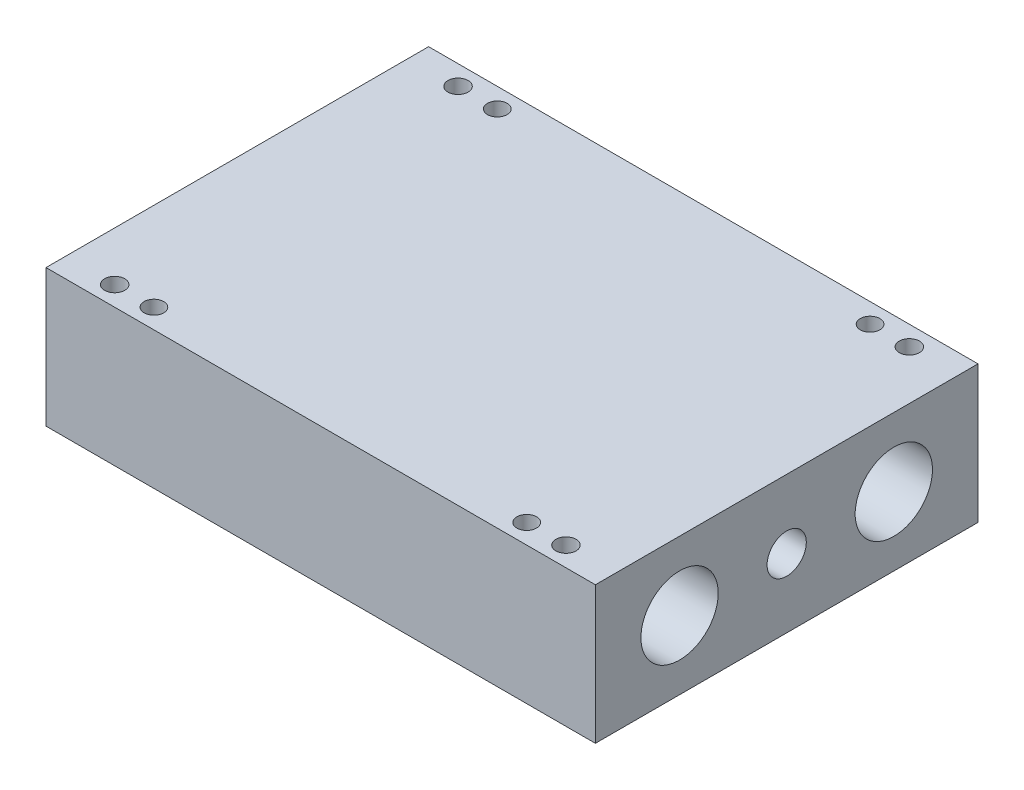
ISO-10303-21;
HEADER;
FILE_DESCRIPTION(('STEP AP214'),'2;1');
FILE_NAME('part.step','',(''),(''),'','','');
FILE_SCHEMA(('AUTOMOTIVE_DESIGN { 1 0 10303 214 1 1 1 1 }'));
ENDSEC;
DATA;
#1=APPLICATION_CONTEXT('core data for automotive mechanical design processes');
#2=APPLICATION_PROTOCOL_DEFINITION('international standard','automotive_design',2000,#1);
#3=PRODUCT_CONTEXT('',#1,'mechanical');
#4=PRODUCT('Part','Part','',(#3));
#5=PRODUCT_RELATED_PRODUCT_CATEGORY('part','',(#4));
#6=PRODUCT_DEFINITION_FORMATION('','',#4);
#7=PRODUCT_DEFINITION_CONTEXT('part definition',#1,'design');
#8=PRODUCT_DEFINITION('design','',#6,#7);
#9=PRODUCT_DEFINITION_SHAPE('','',#8);
#10=(LENGTH_UNIT() NAMED_UNIT(*) SI_UNIT(.MILLI.,.METRE.));
#11=(NAMED_UNIT(*) PLANE_ANGLE_UNIT() SI_UNIT($,.RADIAN.));
#12=(NAMED_UNIT(*) SI_UNIT($,.STERADIAN.) SOLID_ANGLE_UNIT());
#13=UNCERTAINTY_MEASURE_WITH_UNIT(LENGTH_MEASURE(1.E-05),#10,'distance_accuracy_value','');
#14=(GEOMETRIC_REPRESENTATION_CONTEXT(3) GLOBAL_UNCERTAINTY_ASSIGNED_CONTEXT((#13)) GLOBAL_UNIT_ASSIGNED_CONTEXT((#10,
#11,#12)) REPRESENTATION_CONTEXT('',''));
#15=CARTESIAN_POINT('',(0.,0.,0.));
#16=DIRECTION('',(0.,0.,1.));
#17=DIRECTION('',(1.,0.,0.));
#18=AXIS2_PLACEMENT_3D('',#15,#16,#17);
#19=CARTESIAN_POINT('',(88.9,22.225,-61.9125));
#20=DIRECTION('',(0.,-1.,0.));
#21=DIRECTION('',(0.,0.,-1.));
#22=AXIS2_PLACEMENT_3D('',#19,#20,#21);
#23=PLANE('',#22);
#24=CARTESIAN_POINT('',(-60.325,22.225,-55.5625));
#25=DIRECTION('',(0.,1.,0.));
#26=DIRECTION('',(0.,0.,1.));
#27=AXIS2_PLACEMENT_3D('',#24,#25,#26);
#28=CIRCLE('',#27,3.17500000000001);
#29=CARTESIAN_POINT('',(-60.325,22.225,-52.3875));
#30=VERTEX_POINT('',#29);
#31=EDGE_CURVE('E177',#30,#30,#28,.T.);
#32=ORIENTED_EDGE('',*,*,#31,.F.);
#33=EDGE_LOOP('',(#32));
#34=FACE_BOUND('',#33,.T.);
#35=CARTESIAN_POINT('',(60.325,22.225,-55.5625));
#36=DIRECTION('',(0.,1.,0.));
#37=DIRECTION('',(0.,0.,1.));
#38=AXIS2_PLACEMENT_3D('',#35,#36,#37);
#39=CIRCLE('',#38,3.17500000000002);
#40=CARTESIAN_POINT('',(60.325,22.225,-52.3875));
#41=VERTEX_POINT('',#40);
#42=EDGE_CURVE('E181',#41,#41,#39,.T.);
#43=ORIENTED_EDGE('',*,*,#42,.F.);
#44=EDGE_LOOP('',(#43));
#45=FACE_BOUND('',#44,.T.);
#46=CARTESIAN_POINT('',(60.325,22.225,55.5625));
#47=DIRECTION('',(0.,1.,0.));
#48=DIRECTION('',(0.,0.,1.));
#49=AXIS2_PLACEMENT_3D('',#46,#47,#48);
#50=CIRCLE('',#49,3.17500000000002);
#51=CARTESIAN_POINT('',(60.325,22.225,58.7375));
#52=VERTEX_POINT('',#51);
#53=EDGE_CURVE('E185',#52,#52,#50,.T.);
#54=ORIENTED_EDGE('',*,*,#53,.F.);
#55=EDGE_LOOP('',(#54));
#56=FACE_BOUND('',#55,.T.);
#57=CARTESIAN_POINT('',(-60.325,22.225,55.5625));
#58=DIRECTION('',(0.,1.,0.));
#59=DIRECTION('',(0.,0.,1.));
#60=AXIS2_PLACEMENT_3D('',#57,#58,#59);
#61=CIRCLE('',#60,3.17500000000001);
#62=CARTESIAN_POINT('',(-60.325,22.225,58.7375));
#63=VERTEX_POINT('',#62);
#64=EDGE_CURVE('E189',#63,#63,#61,.T.);
#65=ORIENTED_EDGE('',*,*,#64,.F.);
#66=EDGE_LOOP('',(#65));
#67=FACE_BOUND('',#66,.T.);
#68=CARTESIAN_POINT('',(-73.025,22.225,-55.5625));
#69=DIRECTION('',(0.,1.,0.));
#70=DIRECTION('',(0.,0.,1.));
#71=AXIS2_PLACEMENT_3D('',#68,#69,#70);
#72=CIRCLE('',#71,3.26389999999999);
#73=CARTESIAN_POINT('',(-73.025,22.225,-52.2986));
#74=VERTEX_POINT('',#73);
#75=EDGE_CURVE('E107',#74,#74,#72,.T.);
#76=ORIENTED_EDGE('',*,*,#75,.F.);
#77=EDGE_LOOP('',(#76));
#78=FACE_BOUND('',#77,.T.);
#79=CARTESIAN_POINT('',(73.025,22.225,-55.5625));
#80=DIRECTION('',(0.,1.,0.));
#81=DIRECTION('',(0.,0.,1.));
#82=AXIS2_PLACEMENT_3D('',#79,#80,#81);
#83=CIRCLE('',#82,3.26389999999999);
#84=CARTESIAN_POINT('',(73.025,22.225,-52.2986));
#85=VERTEX_POINT('',#84);
#86=EDGE_CURVE('E106',#85,#85,#83,.T.);
#87=ORIENTED_EDGE('',*,*,#86,.F.);
#88=EDGE_LOOP('',(#87));
#89=FACE_BOUND('',#88,.T.);
#90=CARTESIAN_POINT('',(73.025,22.225,55.5625));
#91=DIRECTION('',(0.,1.,0.));
#92=DIRECTION('',(0.,0.,1.));
#93=AXIS2_PLACEMENT_3D('',#90,#91,#92);
#94=CIRCLE('',#93,3.26389999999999);
#95=CARTESIAN_POINT('',(73.025,22.225,58.8264));
#96=VERTEX_POINT('',#95);
#97=EDGE_CURVE('E119',#96,#96,#94,.T.);
#98=ORIENTED_EDGE('',*,*,#97,.F.);
#99=EDGE_LOOP('',(#98));
#100=FACE_BOUND('',#99,.T.);
#101=CARTESIAN_POINT('',(-73.025,22.225,55.5625));
#102=DIRECTION('',(0.,1.,0.));
#103=DIRECTION('',(0.,0.,1.));
#104=AXIS2_PLACEMENT_3D('',#101,#102,#103);
#105=CIRCLE('',#104,3.26389999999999);
#106=CARTESIAN_POINT('',(-73.025,22.225,58.8264));
#107=VERTEX_POINT('',#106);
#108=EDGE_CURVE('E125',#107,#107,#105,.T.);
#109=ORIENTED_EDGE('',*,*,#108,.F.);
#110=EDGE_LOOP('',(#109));
#111=FACE_BOUND('',#110,.T.);
#112=DIRECTION('',(0.,0.,1.));
#113=VECTOR('',#112,1.);
#114=CARTESIAN_POINT('',(-88.9,22.225,-61.9125));
#115=LINE('',#114,#113);
#116=CARTESIAN_POINT('',(-88.9,22.225,-61.9125));
#117=VERTEX_POINT('',#116);
#118=CARTESIAN_POINT('',(-88.9,22.225,61.9125));
#119=VERTEX_POINT('',#118);
#120=EDGE_CURVE('E131',#117,#119,#115,.T.);
#121=ORIENTED_EDGE('',*,*,#120,.T.);
#122=DIRECTION('',(-1.,0.,0.));
#123=VECTOR('',#122,1.);
#124=CARTESIAN_POINT('',(88.9,22.225,61.9125));
#125=LINE('',#124,#123);
#126=CARTESIAN_POINT('',(88.9,22.225,61.9125));
#127=VERTEX_POINT('',#126);
#128=EDGE_CURVE('E11',#127,#119,#125,.T.);
#129=ORIENTED_EDGE('',*,*,#128,.F.);
#130=DIRECTION('',(0.,0.,1.));
#131=VECTOR('',#130,1.);
#132=CARTESIAN_POINT('',(88.9,22.225,-61.9125));
#133=LINE('',#132,#131);
#134=CARTESIAN_POINT('',(88.9,22.225,-61.9125));
#135=VERTEX_POINT('',#134);
#136=EDGE_CURVE('E132',#135,#127,#133,.T.);
#137=ORIENTED_EDGE('',*,*,#136,.F.);
#138=DIRECTION('',(-1.,0.,0.));
#139=VECTOR('',#138,1.);
#140=CARTESIAN_POINT('',(88.9,22.225,-61.9125));
#141=LINE('',#140,#139);
#142=EDGE_CURVE('E138',#135,#117,#141,.T.);
#143=ORIENTED_EDGE('',*,*,#142,.T.);
#144=EDGE_LOOP('',(#121,#129,#137,#143));
#145=FACE_BOUND('',#144,.T.);
#146=ADVANCED_FACE('F36',(#34,#45,#56,#67,#78,#89,#100,#111,#145),#23,.F.);
#147=CARTESIAN_POINT('',(88.9,22.225,61.9125));
#148=DIRECTION('',(0.,0.,-1.));
#149=DIRECTION('',(0.,1.,0.));
#150=AXIS2_PLACEMENT_3D('',#147,#148,#149);
#151=PLANE('',#150);
#152=DIRECTION('',(0.,-1.,0.));
#153=VECTOR('',#152,1.);
#154=CARTESIAN_POINT('',(-88.9,22.225,61.9125));
#155=LINE('',#154,#153);
#156=CARTESIAN_POINT('',(-88.9,-22.225,61.9125));
#157=VERTEX_POINT('',#156);
#158=EDGE_CURVE('E141',#119,#157,#155,.T.);
#159=ORIENTED_EDGE('',*,*,#158,.T.);
#160=DIRECTION('',(-1.,0.,0.));
#161=VECTOR('',#160,1.);
#162=CARTESIAN_POINT('',(88.9,-22.225,61.9125));
#163=LINE('',#162,#161);
#164=CARTESIAN_POINT('',(88.9,-22.225,61.9125));
#165=VERTEX_POINT('',#164);
#166=EDGE_CURVE('E44',#165,#157,#163,.T.);
#167=ORIENTED_EDGE('',*,*,#166,.F.);
#168=DIRECTION('',(0.,-1.,0.));
#169=VECTOR('',#168,1.);
#170=CARTESIAN_POINT('',(88.9,22.225,61.9125));
#171=LINE('',#170,#169);
#172=EDGE_CURVE('E83',#127,#165,#171,.T.);
#173=ORIENTED_EDGE('',*,*,#172,.F.);
#174=ORIENTED_EDGE('',*,*,#128,.T.);
#175=EDGE_LOOP('',(#159,#167,#173,#174));
#176=FACE_BOUND('',#175,.T.);
#177=ADVANCED_FACE('F165',(#176),#151,.F.);
#178=CARTESIAN_POINT('',(88.9,-22.225,61.9125));
#179=DIRECTION('',(0.,1.,0.));
#180=DIRECTION('',(0.,0.,1.));
#181=AXIS2_PLACEMENT_3D('',#178,#179,#180);
#182=PLANE('',#181);
#183=CARTESIAN_POINT('',(-60.325,-22.225,-55.5625));
#184=DIRECTION('',(0.,1.,0.));
#185=DIRECTION('',(0.,0.,1.));
#186=AXIS2_PLACEMENT_3D('',#183,#184,#185);
#187=CIRCLE('',#186,3.17500000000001);
#188=CARTESIAN_POINT('',(-60.325,-22.225,-52.3875));
#189=VERTEX_POINT('',#188);
#190=EDGE_CURVE('E233',#189,#189,#187,.T.);
#191=ORIENTED_EDGE('',*,*,#190,.T.);
#192=EDGE_LOOP('',(#191));
#193=FACE_BOUND('',#192,.T.);
#194=CARTESIAN_POINT('',(60.325,-22.225,-55.5625));
#195=DIRECTION('',(0.,1.,0.));
#196=DIRECTION('',(0.,0.,1.));
#197=AXIS2_PLACEMENT_3D('',#194,#195,#196);
#198=CIRCLE('',#197,3.175);
#199=CARTESIAN_POINT('',(60.325,-22.225,-52.3875));
#200=VERTEX_POINT('',#199);
#201=EDGE_CURVE('E244',#200,#200,#198,.T.);
#202=ORIENTED_EDGE('',*,*,#201,.T.);
#203=EDGE_LOOP('',(#202));
#204=FACE_BOUND('',#203,.T.);
#205=CARTESIAN_POINT('',(60.325,-22.225,55.5625));
#206=DIRECTION('',(0.,1.,0.));
#207=DIRECTION('',(0.,0.,1.));
#208=AXIS2_PLACEMENT_3D('',#205,#206,#207);
#209=CIRCLE('',#208,3.175);
#210=CARTESIAN_POINT('',(60.325,-22.225,58.7375));
#211=VERTEX_POINT('',#210);
#212=EDGE_CURVE('E248',#211,#211,#209,.T.);
#213=ORIENTED_EDGE('',*,*,#212,.T.);
#214=EDGE_LOOP('',(#213));
#215=FACE_BOUND('',#214,.T.);
#216=CARTESIAN_POINT('',(-60.325,-22.225,55.5625));
#217=DIRECTION('',(0.,1.,0.));
#218=DIRECTION('',(0.,0.,1.));
#219=AXIS2_PLACEMENT_3D('',#216,#217,#218);
#220=CIRCLE('',#219,3.17500000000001);
#221=CARTESIAN_POINT('',(-60.325,-22.225,58.7375));
#222=VERTEX_POINT('',#221);
#223=EDGE_CURVE('E113',#222,#222,#220,.T.);
#224=ORIENTED_EDGE('',*,*,#223,.T.);
#225=EDGE_LOOP('',(#224));
#226=FACE_BOUND('',#225,.T.);
#227=DIRECTION('',(0.,0.,-1.));
#228=VECTOR('',#227,1.);
#229=CARTESIAN_POINT('',(-88.9,-22.225,61.9125));
#230=LINE('',#229,#228);
#231=CARTESIAN_POINT('',(-88.9,-22.225,-61.9125));
#232=VERTEX_POINT('',#231);
#233=EDGE_CURVE('E70',#157,#232,#230,.T.);
#234=ORIENTED_EDGE('',*,*,#233,.T.);
#235=DIRECTION('',(-1.,0.,0.));
#236=VECTOR('',#235,1.);
#237=CARTESIAN_POINT('',(88.9,-22.225,-61.9125));
#238=LINE('',#237,#236);
#239=CARTESIAN_POINT('',(88.9,-22.225,-61.9125));
#240=VERTEX_POINT('',#239);
#241=EDGE_CURVE('E146',#240,#232,#238,.T.);
#242=ORIENTED_EDGE('',*,*,#241,.F.);
#243=DIRECTION('',(0.,0.,-1.));
#244=VECTOR('',#243,1.);
#245=CARTESIAN_POINT('',(88.9,-22.225,61.9125));
#246=LINE('',#245,#244);
#247=EDGE_CURVE('E135',#165,#240,#246,.T.);
#248=ORIENTED_EDGE('',*,*,#247,.F.);
#249=ORIENTED_EDGE('',*,*,#166,.T.);
#250=EDGE_LOOP('',(#234,#242,#248,#249));
#251=FACE_BOUND('',#250,.T.);
#252=ADVANCED_FACE('F148',(#193,#204,#215,#226,#251),#182,.F.);
#253=CARTESIAN_POINT('',(88.9,-22.225,-61.9125));
#254=DIRECTION('',(0.,0.,1.));
#255=DIRECTION('',(1.,0.,0.));
#256=AXIS2_PLACEMENT_3D('',#253,#254,#255);
#257=PLANE('',#256);
#258=DIRECTION('',(0.,1.,0.));
#259=VECTOR('',#258,1.);
#260=CARTESIAN_POINT('',(-88.9,-22.225,-61.9125));
#261=LINE('',#260,#259);
#262=EDGE_CURVE('E76',#232,#117,#261,.T.);
#263=ORIENTED_EDGE('',*,*,#262,.T.);
#264=ORIENTED_EDGE('',*,*,#142,.F.);
#265=DIRECTION('',(0.,1.,0.));
#266=VECTOR('',#265,1.);
#267=CARTESIAN_POINT('',(88.9,-22.225,-61.9125));
#268=LINE('',#267,#266);
#269=EDGE_CURVE('E52',#240,#135,#268,.T.);
#270=ORIENTED_EDGE('',*,*,#269,.F.);
#271=ORIENTED_EDGE('',*,*,#241,.T.);
#272=EDGE_LOOP('',(#263,#264,#270,#271));
#273=FACE_BOUND('',#272,.T.);
#274=ADVANCED_FACE('F155',(#273),#257,.F.);
#275=CARTESIAN_POINT('',(88.9,22.225,61.9125));
#276=DIRECTION('',(1.,0.,0.));
#277=DIRECTION('',(0.,0.,-1.));
#278=AXIS2_PLACEMENT_3D('',#275,#276,#277);
#279=PLANE('',#278);
#280=CARTESIAN_POINT('',(88.9,0.,-34.671));
#281=DIRECTION('',(1.,0.,0.));
#282=DIRECTION('',(0.,0.,-1.));
#283=AXIS2_PLACEMENT_3D('',#280,#281,#282);
#284=CIRCLE('',#283,12.5095);
#285=CARTESIAN_POINT('',(88.9,0.,-47.1805));
#286=VERTEX_POINT('',#285);
#287=EDGE_CURVE('E402',#286,#286,#284,.T.);
#288=ORIENTED_EDGE('',*,*,#287,.F.);
#289=EDGE_LOOP('',(#288));
#290=FACE_BOUND('',#289,.T.);
#291=CARTESIAN_POINT('',(88.9,0.,0.));
#292=DIRECTION('',(1.,0.,0.));
#293=DIRECTION('',(0.,0.,-1.));
#294=AXIS2_PLACEMENT_3D('',#291,#292,#293);
#295=CIRCLE('',#294,6.35);
#296=CARTESIAN_POINT('',(88.9,0.,-6.35));
#297=VERTEX_POINT('',#296);
#298=EDGE_CURVE('E238',#297,#297,#295,.T.);
#299=ORIENTED_EDGE('',*,*,#298,.F.);
#300=EDGE_LOOP('',(#299));
#301=FACE_BOUND('',#300,.T.);
#302=CARTESIAN_POINT('',(88.9,0.,34.671));
#303=DIRECTION('',(1.,0.,0.));
#304=DIRECTION('',(0.,0.,-1.));
#305=AXIS2_PLACEMENT_3D('',#302,#303,#304);
#306=CIRCLE('',#305,12.5095);
#307=CARTESIAN_POINT('',(88.9,0.,22.1615));
#308=VERTEX_POINT('',#307);
#309=EDGE_CURVE('E231',#308,#308,#306,.T.);
#310=ORIENTED_EDGE('',*,*,#309,.F.);
#311=EDGE_LOOP('',(#310));
#312=FACE_BOUND('',#311,.T.);
#313=ORIENTED_EDGE('',*,*,#136,.T.);
#314=ORIENTED_EDGE('',*,*,#172,.T.);
#315=ORIENTED_EDGE('',*,*,#247,.T.);
#316=ORIENTED_EDGE('',*,*,#269,.T.);
#317=EDGE_LOOP('',(#313,#314,#315,#316));
#318=FACE_BOUND('',#317,.T.);
#319=ADVANCED_FACE('F157',(#290,#301,#312,#318),#279,.T.);
#320=CARTESIAN_POINT('',(-88.9,22.225,61.9125));
#321=DIRECTION('',(1.,0.,0.));
#322=DIRECTION('',(0.,0.,-1.));
#323=AXIS2_PLACEMENT_3D('',#320,#321,#322);
#324=PLANE('',#323);
#325=CARTESIAN_POINT('',(-88.9,0.,-34.671));
#326=DIRECTION('',(1.,0.,0.));
#327=DIRECTION('',(0.,0.,-1.));
#328=AXIS2_PLACEMENT_3D('',#325,#326,#327);
#329=CIRCLE('',#328,12.5095);
#330=CARTESIAN_POINT('',(-88.9,0.,-47.1805));
#331=VERTEX_POINT('',#330);
#332=EDGE_CURVE('E222',#331,#331,#329,.T.);
#333=ORIENTED_EDGE('',*,*,#332,.T.);
#334=EDGE_LOOP('',(#333));
#335=FACE_BOUND('',#334,.T.);
#336=CARTESIAN_POINT('',(-88.9,0.,0.));
#337=DIRECTION('',(1.,0.,0.));
#338=DIRECTION('',(0.,0.,-1.));
#339=AXIS2_PLACEMENT_3D('',#336,#337,#338);
#340=CIRCLE('',#339,6.35);
#341=CARTESIAN_POINT('',(-88.9,0.,-6.35));
#342=VERTEX_POINT('',#341);
#343=EDGE_CURVE('E226',#342,#342,#340,.T.);
#344=ORIENTED_EDGE('',*,*,#343,.T.);
#345=EDGE_LOOP('',(#344));
#346=FACE_BOUND('',#345,.T.);
#347=CARTESIAN_POINT('',(-88.9,0.,34.671));
#348=DIRECTION('',(1.,0.,0.));
#349=DIRECTION('',(0.,0.,-1.));
#350=AXIS2_PLACEMENT_3D('',#347,#348,#349);
#351=CIRCLE('',#350,12.5095);
#352=CARTESIAN_POINT('',(-88.9,0.,22.1615));
#353=VERTEX_POINT('',#352);
#354=EDGE_CURVE('E229',#353,#353,#351,.T.);
#355=ORIENTED_EDGE('',*,*,#354,.T.);
#356=EDGE_LOOP('',(#355));
#357=FACE_BOUND('',#356,.T.);
#358=ORIENTED_EDGE('',*,*,#120,.F.);
#359=ORIENTED_EDGE('',*,*,#262,.F.);
#360=ORIENTED_EDGE('',*,*,#233,.F.);
#361=ORIENTED_EDGE('',*,*,#158,.F.);
#362=EDGE_LOOP('',(#358,#359,#360,#361));
#363=FACE_BOUND('',#362,.T.);
#364=ADVANCED_FACE('F151',(#335,#346,#357,#363),#324,.F.);
#365=CARTESIAN_POINT('',(-73.025,2.46379999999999,55.5625));
#366=DIRECTION('',(0.,1.,0.));
#367=DIRECTION('',(0.,0.,1.));
#368=AXIS2_PLACEMENT_3D('',#365,#366,#367);
#369=CONICAL_SURFACE('',#368,3.26389999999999,1.02974425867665);
#370=CARTESIAN_POINT('',(-73.025,0.502651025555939,55.5625));
#371=VERTEX_POINT('',#370);
#372=VERTEX_LOOP('',#371);
#373=FACE_BOUND('',#372,.T.);
#374=CARTESIAN_POINT('',(-73.025,2.46379999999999,55.5625));
#375=DIRECTION('',(0.,1.,0.));
#376=DIRECTION('',(0.,0.,1.));
#377=AXIS2_PLACEMENT_3D('',#374,#375,#376);
#378=CIRCLE('',#377,3.26389999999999);
#379=CARTESIAN_POINT('',(-73.025,2.46379999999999,58.8264));
#380=VERTEX_POINT('',#379);
#381=EDGE_CURVE('E128',#380,#380,#378,.T.);
#382=ORIENTED_EDGE('',*,*,#381,.T.);
#383=EDGE_LOOP('',(#382));
#384=FACE_BOUND('',#383,.T.);
#385=ADVANCED_FACE('F201',(#373,#384),#369,.F.);
#386=CARTESIAN_POINT('',(-73.025,22.225,55.5625));
#387=DIRECTION('',(0.,1.,0.));
#388=DIRECTION('',(0.,0.,1.));
#389=AXIS2_PLACEMENT_3D('',#386,#387,#388);
#390=CYLINDRICAL_SURFACE('',#389,3.26389999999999);
#391=ORIENTED_EDGE('',*,*,#381,.F.);
#392=EDGE_LOOP('',(#391));
#393=FACE_BOUND('',#392,.T.);
#394=ORIENTED_EDGE('',*,*,#108,.T.);
#395=EDGE_LOOP('',(#394));
#396=FACE_BOUND('',#395,.T.);
#397=ADVANCED_FACE('F198',(#393,#396),#390,.F.);
#398=CARTESIAN_POINT('',(73.025,2.46379999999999,55.5625));
#399=DIRECTION('',(0.,1.,0.));
#400=DIRECTION('',(0.,0.,1.));
#401=AXIS2_PLACEMENT_3D('',#398,#399,#400);
#402=CONICAL_SURFACE('',#401,3.26389999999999,1.02974425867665);
#403=CARTESIAN_POINT('',(73.025,0.502651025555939,55.5625));
#404=VERTEX_POINT('',#403);
#405=VERTEX_LOOP('',#404);
#406=FACE_BOUND('',#405,.T.);
#407=CARTESIAN_POINT('',(73.025,2.46379999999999,55.5625));
#408=DIRECTION('',(0.,1.,0.));
#409=DIRECTION('',(0.,0.,1.));
#410=AXIS2_PLACEMENT_3D('',#407,#408,#409);
#411=CIRCLE('',#410,3.26389999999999);
#412=CARTESIAN_POINT('',(73.025,2.46379999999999,58.8264));
#413=VERTEX_POINT('',#412);
#414=EDGE_CURVE('E122',#413,#413,#411,.T.);
#415=ORIENTED_EDGE('',*,*,#414,.T.);
#416=EDGE_LOOP('',(#415));
#417=FACE_BOUND('',#416,.T.);
#418=ADVANCED_FACE('F200',(#406,#417),#402,.F.);
#419=CARTESIAN_POINT('',(73.025,22.225,55.5625));
#420=DIRECTION('',(0.,1.,0.));
#421=DIRECTION('',(0.,0.,1.));
#422=AXIS2_PLACEMENT_3D('',#419,#420,#421);
#423=CYLINDRICAL_SURFACE('',#422,3.26389999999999);
#424=ORIENTED_EDGE('',*,*,#414,.F.);
#425=EDGE_LOOP('',(#424));
#426=FACE_BOUND('',#425,.T.);
#427=ORIENTED_EDGE('',*,*,#97,.T.);
#428=EDGE_LOOP('',(#427));
#429=FACE_BOUND('',#428,.T.);
#430=ADVANCED_FACE('F208',(#426,#429),#423,.F.);
#431=CARTESIAN_POINT('',(73.025,2.4638,-55.5625));
#432=DIRECTION('',(0.,1.,0.));
#433=DIRECTION('',(0.,0.,1.));
#434=AXIS2_PLACEMENT_3D('',#431,#432,#433);
#435=CONICAL_SURFACE('',#434,3.26389999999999,1.02974425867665);
#436=CARTESIAN_POINT('',(73.025,0.502651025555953,-55.5625));
#437=VERTEX_POINT('',#436);
#438=VERTEX_LOOP('',#437);
#439=FACE_BOUND('',#438,.T.);
#440=CARTESIAN_POINT('',(73.025,2.4638,-55.5625));
#441=DIRECTION('',(0.,1.,0.));
#442=DIRECTION('',(0.,0.,1.));
#443=AXIS2_PLACEMENT_3D('',#440,#441,#442);
#444=CIRCLE('',#443,3.26389999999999);
#445=CARTESIAN_POINT('',(73.025,2.4638,-52.2986));
#446=VERTEX_POINT('',#445);
#447=EDGE_CURVE('E110',#446,#446,#444,.T.);
#448=ORIENTED_EDGE('',*,*,#447,.T.);
#449=EDGE_LOOP('',(#448));
#450=FACE_BOUND('',#449,.T.);
#451=ADVANCED_FACE('F272',(#439,#450),#435,.F.);
#452=CARTESIAN_POINT('',(73.025,22.225,-55.5625));
#453=DIRECTION('',(0.,1.,0.));
#454=DIRECTION('',(0.,0.,1.));
#455=AXIS2_PLACEMENT_3D('',#452,#453,#454);
#456=CYLINDRICAL_SURFACE('',#455,3.26389999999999);
#457=ORIENTED_EDGE('',*,*,#447,.F.);
#458=EDGE_LOOP('',(#457));
#459=FACE_BOUND('',#458,.T.);
#460=ORIENTED_EDGE('',*,*,#86,.T.);
#461=EDGE_LOOP('',(#460));
#462=FACE_BOUND('',#461,.T.);
#463=ADVANCED_FACE('F100',(#459,#462),#456,.F.);
#464=CARTESIAN_POINT('',(-73.025,2.4638,-55.5625));
#465=DIRECTION('',(0.,1.,0.));
#466=DIRECTION('',(0.,0.,1.));
#467=AXIS2_PLACEMENT_3D('',#464,#465,#466);
#468=CONICAL_SURFACE('',#467,3.26389999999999,1.02974425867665);
#469=CARTESIAN_POINT('',(-73.025,0.502651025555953,-55.5625));
#470=VERTEX_POINT('',#469);
#471=VERTEX_LOOP('',#470);
#472=FACE_BOUND('',#471,.T.);
#473=CARTESIAN_POINT('',(-73.025,2.4638,-55.5625));
#474=DIRECTION('',(0.,1.,0.));
#475=DIRECTION('',(0.,0.,1.));
#476=AXIS2_PLACEMENT_3D('',#473,#474,#475);
#477=CIRCLE('',#476,3.26389999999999);
#478=CARTESIAN_POINT('',(-73.025,2.4638,-52.2986));
#479=VERTEX_POINT('',#478);
#480=EDGE_CURVE('E104',#479,#479,#477,.T.);
#481=ORIENTED_EDGE('',*,*,#480,.T.);
#482=EDGE_LOOP('',(#481));
#483=FACE_BOUND('',#482,.T.);
#484=ADVANCED_FACE('F96',(#472,#483),#468,.F.);
#485=CARTESIAN_POINT('',(-73.025,22.225,-55.5625));
#486=DIRECTION('',(0.,1.,0.));
#487=DIRECTION('',(0.,0.,1.));
#488=AXIS2_PLACEMENT_3D('',#485,#486,#487);
#489=CYLINDRICAL_SURFACE('',#488,3.26389999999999);
#490=ORIENTED_EDGE('',*,*,#480,.F.);
#491=EDGE_LOOP('',(#490));
#492=FACE_BOUND('',#491,.T.);
#493=ORIENTED_EDGE('',*,*,#75,.T.);
#494=EDGE_LOOP('',(#493));
#495=FACE_BOUND('',#494,.T.);
#496=ADVANCED_FACE('F99',(#492,#495),#489,.F.);
#497=CARTESIAN_POINT('',(-60.325,22.225,55.5625));
#498=DIRECTION('',(0.,1.,0.));
#499=DIRECTION('',(0.,0.,1.));
#500=AXIS2_PLACEMENT_3D('',#497,#498,#499);
#501=CYLINDRICAL_SURFACE('',#500,3.17500000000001);
#502=ORIENTED_EDGE('',*,*,#223,.F.);
#503=EDGE_LOOP('',(#502));
#504=FACE_BOUND('',#503,.T.);
#505=ORIENTED_EDGE('',*,*,#64,.T.);
#506=EDGE_LOOP('',(#505));
#507=FACE_BOUND('',#506,.T.);
#508=ADVANCED_FACE('F255',(#504,#507),#501,.F.);
#509=CARTESIAN_POINT('',(60.325,22.225,55.5625));
#510=DIRECTION('',(0.,1.,0.));
#511=DIRECTION('',(0.,0.,1.));
#512=AXIS2_PLACEMENT_3D('',#509,#510,#511);
#513=CYLINDRICAL_SURFACE('',#512,3.17500000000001);
#514=ORIENTED_EDGE('',*,*,#212,.F.);
#515=EDGE_LOOP('',(#514));
#516=FACE_BOUND('',#515,.T.);
#517=ORIENTED_EDGE('',*,*,#53,.T.);
#518=EDGE_LOOP('',(#517));
#519=FACE_BOUND('',#518,.T.);
#520=ADVANCED_FACE('F258',(#516,#519),#513,.F.);
#521=CARTESIAN_POINT('',(60.325,22.225,-55.5625));
#522=DIRECTION('',(0.,1.,0.));
#523=DIRECTION('',(0.,0.,1.));
#524=AXIS2_PLACEMENT_3D('',#521,#522,#523);
#525=CYLINDRICAL_SURFACE('',#524,3.17500000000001);
#526=ORIENTED_EDGE('',*,*,#201,.F.);
#527=EDGE_LOOP('',(#526));
#528=FACE_BOUND('',#527,.T.);
#529=ORIENTED_EDGE('',*,*,#42,.T.);
#530=EDGE_LOOP('',(#529));
#531=FACE_BOUND('',#530,.T.);
#532=ADVANCED_FACE('F264',(#528,#531),#525,.F.);
#533=CARTESIAN_POINT('',(-60.325,22.225,-55.5625));
#534=DIRECTION('',(0.,1.,0.));
#535=DIRECTION('',(0.,0.,1.));
#536=AXIS2_PLACEMENT_3D('',#533,#534,#535);
#537=CYLINDRICAL_SURFACE('',#536,3.17500000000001);
#538=ORIENTED_EDGE('',*,*,#190,.F.);
#539=EDGE_LOOP('',(#538));
#540=FACE_BOUND('',#539,.T.);
#541=ORIENTED_EDGE('',*,*,#31,.T.);
#542=EDGE_LOOP('',(#541));
#543=FACE_BOUND('',#542,.T.);
#544=ADVANCED_FACE('F356',(#540,#543),#537,.F.);
#545=CARTESIAN_POINT('',(-88.9,0.,34.671));
#546=DIRECTION('',(1.,0.,0.));
#547=DIRECTION('',(0.,0.,-1.));
#548=AXIS2_PLACEMENT_3D('',#545,#546,#547);
#549=CYLINDRICAL_SURFACE('',#548,12.5095);
#550=ORIENTED_EDGE('',*,*,#354,.F.);
#551=EDGE_LOOP('',(#550));
#552=FACE_BOUND('',#551,.T.);
#553=ORIENTED_EDGE('',*,*,#309,.T.);
#554=EDGE_LOOP('',(#553));
#555=FACE_BOUND('',#554,.T.);
#556=ADVANCED_FACE('F364',(#552,#555),#549,.F.);
#557=CARTESIAN_POINT('',(-88.9,0.,0.));
#558=DIRECTION('',(1.,0.,0.));
#559=DIRECTION('',(0.,0.,-1.));
#560=AXIS2_PLACEMENT_3D('',#557,#558,#559);
#561=CYLINDRICAL_SURFACE('',#560,6.35);
#562=ORIENTED_EDGE('',*,*,#343,.F.);
#563=EDGE_LOOP('',(#562));
#564=FACE_BOUND('',#563,.T.);
#565=ORIENTED_EDGE('',*,*,#298,.T.);
#566=EDGE_LOOP('',(#565));
#567=FACE_BOUND('',#566,.T.);
#568=ADVANCED_FACE('F374',(#564,#567),#561,.F.);
#569=CARTESIAN_POINT('',(-88.9,0.,-34.671));
#570=DIRECTION('',(1.,0.,0.));
#571=DIRECTION('',(0.,0.,-1.));
#572=AXIS2_PLACEMENT_3D('',#569,#570,#571);
#573=CYLINDRICAL_SURFACE('',#572,12.5095);
#574=ORIENTED_EDGE('',*,*,#332,.F.);
#575=EDGE_LOOP('',(#574));
#576=FACE_BOUND('',#575,.T.);
#577=ORIENTED_EDGE('',*,*,#287,.T.);
#578=EDGE_LOOP('',(#577));
#579=FACE_BOUND('',#578,.T.);
#580=ADVANCED_FACE('F382',(#576,#579),#573,.F.);
#581=CLOSED_SHELL('',(#146,#177,#252,#274,#319,#364,#385,#397,#418,#430,#451,#463,#484,#496,
#508,#520,#532,#544,#556,#568,#580));
#582=MANIFOLD_SOLID_BREP('B2',#581);
#583=ADVANCED_BREP_SHAPE_REPRESENTATION('',(#18,#582),#14);
#584=SHAPE_DEFINITION_REPRESENTATION(#9,#583);
ENDSEC;
END-ISO-10303-21;
